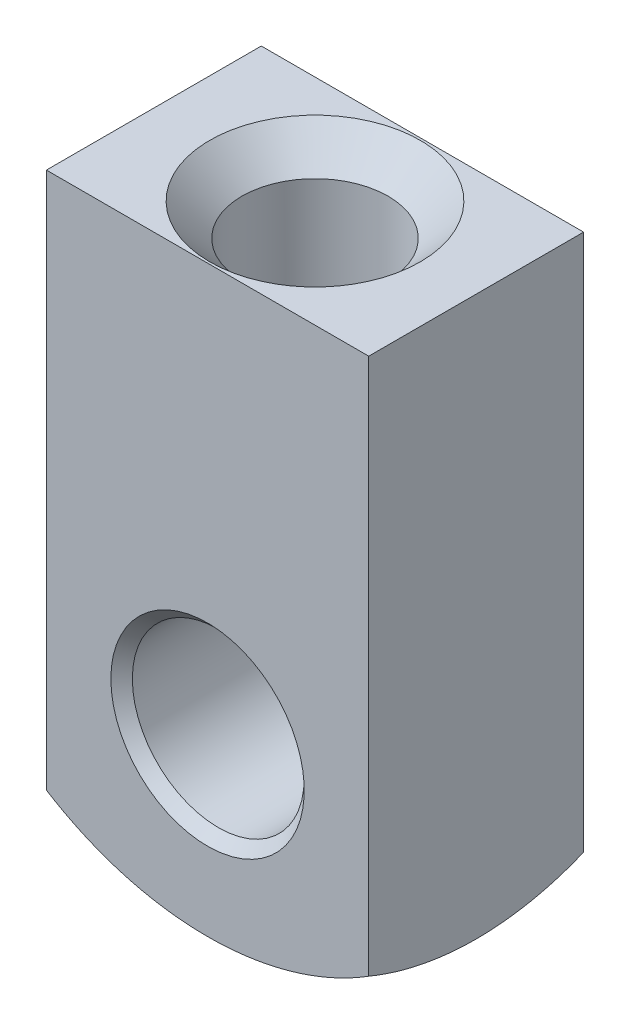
ISO-10303-21;
HEADER;
FILE_DESCRIPTION(('STEP AP214'),'2;1');
FILE_NAME('part.step','',(''),(''),'','','');
FILE_SCHEMA(('AUTOMOTIVE_DESIGN { 1 0 10303 214 1 1 1 1 }'));
ENDSEC;
DATA;
#1=APPLICATION_CONTEXT('core data for automotive mechanical design processes');
#2=APPLICATION_PROTOCOL_DEFINITION('international standard','automotive_design',2000,#1);
#3=PRODUCT_CONTEXT('',#1,'mechanical');
#4=PRODUCT('Part','Part','',(#3));
#5=PRODUCT_RELATED_PRODUCT_CATEGORY('part','',(#4));
#6=PRODUCT_DEFINITION_FORMATION('','',#4);
#7=PRODUCT_DEFINITION_CONTEXT('part definition',#1,'design');
#8=PRODUCT_DEFINITION('design','',#6,#7);
#9=PRODUCT_DEFINITION_SHAPE('','',#8);
#10=(LENGTH_UNIT() NAMED_UNIT(*) SI_UNIT(.MILLI.,.METRE.));
#11=(NAMED_UNIT(*) PLANE_ANGLE_UNIT() SI_UNIT($,.RADIAN.));
#12=(NAMED_UNIT(*) SI_UNIT($,.STERADIAN.) SOLID_ANGLE_UNIT());
#13=UNCERTAINTY_MEASURE_WITH_UNIT(LENGTH_MEASURE(1.E-05),#10,'distance_accuracy_value','');
#14=(GEOMETRIC_REPRESENTATION_CONTEXT(3) GLOBAL_UNCERTAINTY_ASSIGNED_CONTEXT((#13)) GLOBAL_UNIT_ASSIGNED_CONTEXT((#10,
#11,#12)) REPRESENTATION_CONTEXT('',''));
#15=CARTESIAN_POINT('',(0.,0.,0.));
#16=DIRECTION('',(0.,0.,1.));
#17=DIRECTION('',(1.,0.,0.));
#18=AXIS2_PLACEMENT_3D('',#15,#16,#17);
#19=CARTESIAN_POINT('',(-7.50000000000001,-9.,5.));
#20=DIRECTION('',(1.,0.,0.));
#21=DIRECTION('',(0.,1.,0.));
#22=AXIS2_PLACEMENT_3D('',#19,#20,#21);
#23=PLANE('',#22);
#24=CARTESIAN_POINT('',(-7.50000000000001,6.,0.));
#25=DIRECTION('',(1.,0.,0.));
#26=DIRECTION('',(0.,1.,0.));
#27=AXIS2_PLACEMENT_3D('',#24,#25,#26);
#28=CIRCLE('',#27,12.9903810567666);
#29=CARTESIAN_POINT('',(-7.50000000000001,-5.98957880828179,5.));
#30=VERTEX_POINT('',#29);
#31=CARTESIAN_POINT('',(-7.50000000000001,-5.98957880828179,-5.));
#32=VERTEX_POINT('',#31);
#33=EDGE_CURVE('E49',#30,#32,#28,.T.);
#34=ORIENTED_EDGE('',*,*,#33,.F.);
#35=DIRECTION('',(0.,-1.,0.));
#36=VECTOR('',#35,1.);
#37=CARTESIAN_POINT('',(-7.50000000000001,-9.,5.));
#38=LINE('',#37,#36);
#39=CARTESIAN_POINT('',(-7.5,19.,5.));
#40=VERTEX_POINT('',#39);
#41=EDGE_CURVE('E81',#40,#30,#38,.T.);
#42=ORIENTED_EDGE('',*,*,#41,.F.);
#43=DIRECTION('',(0.,0.,-1.));
#44=VECTOR('',#43,1.);
#45=CARTESIAN_POINT('',(-7.5,19.,5.));
#46=LINE('',#45,#44);
#47=CARTESIAN_POINT('',(-7.5,19.,-5.));
#48=VERTEX_POINT('',#47);
#49=EDGE_CURVE('E74',#40,#48,#46,.T.);
#50=ORIENTED_EDGE('',*,*,#49,.T.);
#51=DIRECTION('',(0.,-1.,0.));
#52=VECTOR('',#51,1.);
#53=CARTESIAN_POINT('',(-7.50000000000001,-9.,-5.));
#54=LINE('',#53,#52);
#55=EDGE_CURVE('E86',#48,#32,#54,.T.);
#56=ORIENTED_EDGE('',*,*,#55,.T.);
#57=EDGE_LOOP('',(#34,#42,#50,#56));
#58=FACE_BOUND('',#57,.T.);
#59=ADVANCED_FACE('F34',(#58),#23,.F.);
#60=CARTESIAN_POINT('',(7.5,-9.,5.));
#61=DIRECTION('',(-1.,0.,0.));
#62=DIRECTION('',(0.,-1.,0.));
#63=AXIS2_PLACEMENT_3D('',#60,#61,#62);
#64=PLANE('',#63);
#65=CARTESIAN_POINT('',(7.5,6.,0.));
#66=DIRECTION('',(-1.,0.,0.));
#67=DIRECTION('',(0.,-1.,0.));
#68=AXIS2_PLACEMENT_3D('',#65,#66,#67);
#69=CIRCLE('',#68,12.9903810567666);
#70=CARTESIAN_POINT('',(7.5,-5.9895788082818,-5.));
#71=VERTEX_POINT('',#70);
#72=CARTESIAN_POINT('',(7.5,-5.9895788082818,5.));
#73=VERTEX_POINT('',#72);
#74=EDGE_CURVE('E242',#71,#73,#69,.T.);
#75=ORIENTED_EDGE('',*,*,#74,.F.);
#76=DIRECTION('',(0.,1.,0.));
#77=VECTOR('',#76,1.);
#78=CARTESIAN_POINT('',(7.5,-9.,-5.));
#79=LINE('',#78,#77);
#80=CARTESIAN_POINT('',(7.5,19.,-5.));
#81=VERTEX_POINT('',#80);
#82=EDGE_CURVE('E82',#71,#81,#79,.T.);
#83=ORIENTED_EDGE('',*,*,#82,.T.);
#84=DIRECTION('',(0.,0.,-1.));
#85=VECTOR('',#84,1.);
#86=CARTESIAN_POINT('',(7.5,19.,5.));
#87=LINE('',#86,#85);
#88=CARTESIAN_POINT('',(7.5,19.,5.));
#89=VERTEX_POINT('',#88);
#90=EDGE_CURVE('E77',#89,#81,#87,.T.);
#91=ORIENTED_EDGE('',*,*,#90,.F.);
#92=DIRECTION('',(0.,1.,0.));
#93=VECTOR('',#92,1.);
#94=CARTESIAN_POINT('',(7.5,-9.,5.));
#95=LINE('',#94,#93);
#96=EDGE_CURVE('E246',#73,#89,#95,.T.);
#97=ORIENTED_EDGE('',*,*,#96,.F.);
#98=EDGE_LOOP('',(#75,#83,#91,#97));
#99=FACE_BOUND('',#98,.T.);
#100=ADVANCED_FACE('F125',(#99),#64,.F.);
#101=CARTESIAN_POINT('',(0.,0.,5.));
#102=DIRECTION('',(0.,0.,-1.));
#103=DIRECTION('',(-1.,0.,0.));
#104=AXIS2_PLACEMENT_3D('',#101,#102,#103);
#105=PLANE('',#104);
#106=CARTESIAN_POINT('',(0.,0.,5.));
#107=DIRECTION('',(0.,0.,-1.));
#108=DIRECTION('',(-1.,0.,0.));
#109=AXIS2_PLACEMENT_3D('',#106,#107,#108);
#110=CIRCLE('',#109,4.50000000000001);
#111=CARTESIAN_POINT('',(-4.50000000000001,0.,5.));
#112=VERTEX_POINT('',#111);
#113=EDGE_CURVE('E105',#112,#112,#110,.T.);
#114=ORIENTED_EDGE('',*,*,#113,.T.);
#115=EDGE_LOOP('',(#114));
#116=FACE_BOUND('',#115,.T.);
#117=CARTESIAN_POINT('',(0.,6.,5.));
#118=DIRECTION('',(0.,0.,-1.));
#119=DIRECTION('',(-1.,0.,0.));
#120=AXIS2_PLACEMENT_3D('',#117,#118,#119);
#121=CIRCLE('',#120,14.142135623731);
#122=EDGE_CURVE('E90',#73,#30,#121,.T.);
#123=ORIENTED_EDGE('',*,*,#122,.F.);
#124=ORIENTED_EDGE('',*,*,#96,.T.);
#125=DIRECTION('',(-1.,0.,0.));
#126=VECTOR('',#125,1.);
#127=CARTESIAN_POINT('',(-7.5,19.,5.));
#128=LINE('',#127,#126);
#129=EDGE_CURVE('E58',#89,#40,#128,.T.);
#130=ORIENTED_EDGE('',*,*,#129,.T.);
#131=ORIENTED_EDGE('',*,*,#41,.T.);
#132=EDGE_LOOP('',(#123,#124,#130,#131));
#133=FACE_BOUND('',#132,.T.);
#134=ADVANCED_FACE('F130',(#116,#133),#105,.F.);
#135=CARTESIAN_POINT('',(0.,0.,-5.));
#136=DIRECTION('',(0.,0.,-1.));
#137=DIRECTION('',(-1.,0.,0.));
#138=AXIS2_PLACEMENT_3D('',#135,#136,#137);
#139=PLANE('',#138);
#140=CARTESIAN_POINT('',(0.,0.,-5.));
#141=DIRECTION('',(0.,0.,-1.));
#142=DIRECTION('',(-1.,0.,0.));
#143=AXIS2_PLACEMENT_3D('',#140,#141,#142);
#144=CIRCLE('',#143,4.5);
#145=CARTESIAN_POINT('',(-4.5,0.,-5.));
#146=VERTEX_POINT('',#145);
#147=EDGE_CURVE('E108',#146,#146,#144,.F.);
#148=ORIENTED_EDGE('',*,*,#147,.T.);
#149=EDGE_LOOP('',(#148));
#150=FACE_BOUND('',#149,.T.);
#151=ORIENTED_EDGE('',*,*,#82,.F.);
#152=CARTESIAN_POINT('',(0.,6.,-5.));
#153=DIRECTION('',(0.,0.,-1.));
#154=DIRECTION('',(-1.,0.,0.));
#155=AXIS2_PLACEMENT_3D('',#152,#153,#154);
#156=CIRCLE('',#155,14.142135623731);
#157=EDGE_CURVE('E89',#71,#32,#156,.T.);
#158=ORIENTED_EDGE('',*,*,#157,.T.);
#159=ORIENTED_EDGE('',*,*,#55,.F.);
#160=DIRECTION('',(-1.,0.,0.));
#161=VECTOR('',#160,1.);
#162=CARTESIAN_POINT('',(-7.5,19.,-5.));
#163=LINE('',#162,#161);
#164=EDGE_CURVE('E71',#81,#48,#163,.T.);
#165=ORIENTED_EDGE('',*,*,#164,.F.);
#166=EDGE_LOOP('',(#151,#158,#159,#165));
#167=FACE_BOUND('',#166,.T.);
#168=ADVANCED_FACE('F88',(#150,#167),#139,.T.);
#169=CARTESIAN_POINT('',(-7.5,19.,5.));
#170=DIRECTION('',(0.,-1.,0.));
#171=DIRECTION('',(1.,0.,0.));
#172=AXIS2_PLACEMENT_3D('',#169,#170,#171);
#173=PLANE('',#172);
#174=CARTESIAN_POINT('',(0.,19.,0.));
#175=DIRECTION('',(0.,-1.,0.));
#176=DIRECTION('',(1.,0.,0.));
#177=AXIS2_PLACEMENT_3D('',#174,#175,#176);
#178=CIRCLE('',#177,4.89999999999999);
#179=CARTESIAN_POINT('',(4.89999999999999,19.,0.));
#180=VERTEX_POINT('',#179);
#181=EDGE_CURVE('E11',#180,#180,#178,.T.);
#182=ORIENTED_EDGE('',*,*,#181,.T.);
#183=EDGE_LOOP('',(#182));
#184=FACE_BOUND('',#183,.T.);
#185=ORIENTED_EDGE('',*,*,#164,.T.);
#186=ORIENTED_EDGE('',*,*,#49,.F.);
#187=ORIENTED_EDGE('',*,*,#129,.F.);
#188=ORIENTED_EDGE('',*,*,#90,.T.);
#189=EDGE_LOOP('',(#185,#186,#187,#188));
#190=FACE_BOUND('',#189,.T.);
#191=ADVANCED_FACE('F73',(#184,#190),#173,.F.);
#192=CARTESIAN_POINT('',(0.,6.,0.));
#193=DIRECTION('',(0.,1.,0.));
#194=DIRECTION('',(1.,0.,0.));
#195=AXIS2_PLACEMENT_3D('',#192,#193,#194);
#196=SPHERICAL_SURFACE('',#195,15.);
#197=CARTESIAN_POINT('',(0.,-9.,0.));
#198=VERTEX_POINT('',#197);
#199=VERTEX_LOOP('',#198);
#200=FACE_BOUND('',#199,.T.);
#201=ORIENTED_EDGE('',*,*,#122,.T.);
#202=ORIENTED_EDGE('',*,*,#33,.T.);
#203=ORIENTED_EDGE('',*,*,#157,.F.);
#204=ORIENTED_EDGE('',*,*,#74,.T.);
#205=EDGE_LOOP('',(#201,#202,#203,#204));
#206=FACE_BOUND('',#205,.T.);
#207=ADVANCED_FACE('F157',(#200,#206),#196,.T.);
#208=CARTESIAN_POINT('',(0.,0.,-5.));
#209=DIRECTION('',(0.,0.,1.));
#210=DIRECTION('',(1.,0.,0.));
#211=AXIS2_PLACEMENT_3D('',#208,#209,#210);
#212=CYLINDRICAL_SURFACE('',#211,4.);
#213=CARTESIAN_POINT('',(0.,0.,4.49999999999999));
#214=DIRECTION('',(0.,0.,-1.));
#215=DIRECTION('',(-1.,0.,0.));
#216=AXIS2_PLACEMENT_3D('',#213,#214,#215);
#217=CIRCLE('',#216,4.);
#218=CARTESIAN_POINT('',(-4.,0.,4.49999999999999));
#219=VERTEX_POINT('',#218);
#220=EDGE_CURVE('E102',#219,#219,#217,.F.);
#221=ORIENTED_EDGE('',*,*,#220,.T.);
#222=EDGE_LOOP('',(#221));
#223=FACE_BOUND('',#222,.T.);
#224=CARTESIAN_POINT('',(0.,0.,-4.5));
#225=DIRECTION('',(0.,0.,-1.));
#226=DIRECTION('',(-1.,0.,0.));
#227=AXIS2_PLACEMENT_3D('',#224,#225,#226);
#228=CIRCLE('',#227,4.);
#229=CARTESIAN_POINT('',(-4.,0.,-4.5));
#230=VERTEX_POINT('',#229);
#231=EDGE_CURVE('E99',#230,#230,#228,.T.);
#232=ORIENTED_EDGE('',*,*,#231,.T.);
#233=EDGE_LOOP('',(#232));
#234=FACE_BOUND('',#233,.T.);
#235=ADVANCED_FACE('F138',(#223,#234),#212,.F.);
#236=CARTESIAN_POINT('',(0.,0.,4.49999999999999));
#237=DIRECTION('',(0.,0.,1.));
#238=DIRECTION('',(1.,0.,0.));
#239=AXIS2_PLACEMENT_3D('',#236,#237,#238);
#240=CONICAL_SURFACE('',#239,4.,0.785398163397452);
#241=ORIENTED_EDGE('',*,*,#113,.F.);
#242=EDGE_LOOP('',(#241));
#243=FACE_BOUND('',#242,.T.);
#244=ORIENTED_EDGE('',*,*,#220,.F.);
#245=EDGE_LOOP('',(#244));
#246=FACE_BOUND('',#245,.T.);
#247=ADVANCED_FACE('F135',(#243,#246),#240,.F.);
#248=CARTESIAN_POINT('',(0.,0.,-5.));
#249=DIRECTION('',(0.,0.,-1.));
#250=DIRECTION('',(-1.,0.,0.));
#251=AXIS2_PLACEMENT_3D('',#248,#249,#250);
#252=CONICAL_SURFACE('',#251,4.5,0.785398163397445);
#253=ORIENTED_EDGE('',*,*,#231,.F.);
#254=EDGE_LOOP('',(#253));
#255=FACE_BOUND('',#254,.T.);
#256=ORIENTED_EDGE('',*,*,#147,.F.);
#257=EDGE_LOOP('',(#256));
#258=FACE_BOUND('',#257,.T.);
#259=ADVANCED_FACE('F137',(#255,#258),#252,.F.);
#260=CARTESIAN_POINT('',(0.,7.,0.));
#261=DIRECTION('',(0.,1.,0.));
#262=DIRECTION('',(0.,0.,1.));
#263=AXIS2_PLACEMENT_3D('',#260,#261,#262);
#264=CONICAL_SURFACE('',#263,3.4,1.02974425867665);
#265=CARTESIAN_POINT('',(0.,4.9570738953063,0.));
#266=VERTEX_POINT('',#265);
#267=VERTEX_LOOP('',#266);
#268=FACE_BOUND('',#267,.T.);
#269=CARTESIAN_POINT('',(0.,7.,0.));
#270=DIRECTION('',(0.,1.,0.));
#271=DIRECTION('',(0.,0.,1.));
#272=AXIS2_PLACEMENT_3D('',#269,#270,#271);
#273=CIRCLE('',#272,3.4);
#274=CARTESIAN_POINT('',(0.,7.,3.4));
#275=VERTEX_POINT('',#274);
#276=EDGE_CURVE('E250',#275,#275,#273,.T.);
#277=ORIENTED_EDGE('',*,*,#276,.T.);
#278=EDGE_LOOP('',(#277));
#279=FACE_BOUND('',#278,.T.);
#280=ADVANCED_FACE('F121',(#268,#279),#264,.F.);
#281=CARTESIAN_POINT('',(0.,19.,0.));
#282=DIRECTION('',(0.,1.,0.));
#283=DIRECTION('',(0.,0.,1.));
#284=AXIS2_PLACEMENT_3D('',#281,#282,#283);
#285=CYLINDRICAL_SURFACE('',#284,3.39999999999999);
#286=CARTESIAN_POINT('',(0.,17.5,0.));
#287=DIRECTION('',(0.,-1.,0.));
#288=DIRECTION('',(0.,0.,-1.));
#289=AXIS2_PLACEMENT_3D('',#286,#287,#288);
#290=CIRCLE('',#289,3.39999999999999);
#291=CARTESIAN_POINT('',(0.,17.5,-3.39999999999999));
#292=VERTEX_POINT('',#291);
#293=EDGE_CURVE('E42',#292,#292,#290,.F.);
#294=ORIENTED_EDGE('',*,*,#293,.T.);
#295=EDGE_LOOP('',(#294));
#296=FACE_BOUND('',#295,.T.);
#297=ORIENTED_EDGE('',*,*,#276,.F.);
#298=EDGE_LOOP('',(#297));
#299=FACE_BOUND('',#298,.T.);
#300=ADVANCED_FACE('F113',(#296,#299),#285,.F.);
#301=CARTESIAN_POINT('',(0.,17.5,0.));
#302=DIRECTION('',(0.,1.,0.));
#303=DIRECTION('',(0.,0.,1.));
#304=AXIS2_PLACEMENT_3D('',#301,#302,#303);
#305=CONICAL_SURFACE('',#304,3.39999999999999,0.785398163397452);
#306=ORIENTED_EDGE('',*,*,#181,.F.);
#307=EDGE_LOOP('',(#306));
#308=FACE_BOUND('',#307,.T.);
#309=ORIENTED_EDGE('',*,*,#293,.F.);
#310=EDGE_LOOP('',(#309));
#311=FACE_BOUND('',#310,.T.);
#312=ADVANCED_FACE('F36',(#308,#311),#305,.F.);
#313=CLOSED_SHELL('',(#59,#100,#134,#168,#191,#207,#235,#247,#259,#280,#300,#312));
#314=MANIFOLD_SOLID_BREP('B2',#313);
#315=ADVANCED_BREP_SHAPE_REPRESENTATION('',(#18,#314),#14);
#316=SHAPE_DEFINITION_REPRESENTATION(#9,#315);
ENDSEC;
END-ISO-10303-21;
